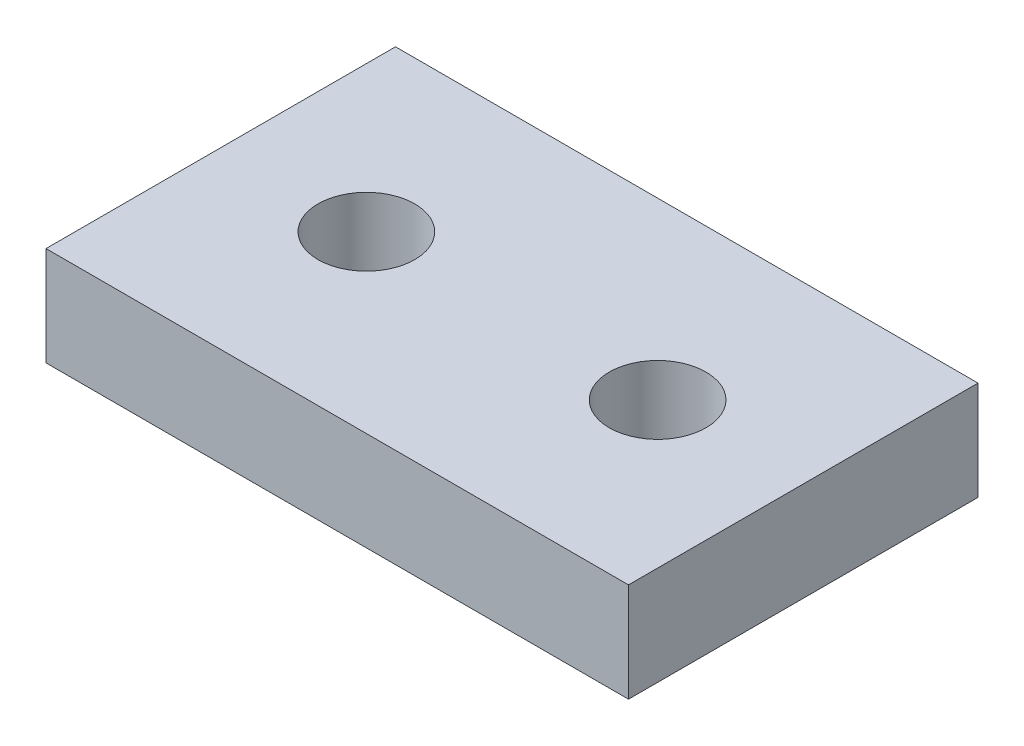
ISO-10303-21;
HEADER;
FILE_DESCRIPTION(('STEP AP214'),'2;1');
FILE_NAME('part.step','',(''),(''),'','','');
FILE_SCHEMA(('AUTOMOTIVE_DESIGN { 1 0 10303 214 1 1 1 1 }'));
ENDSEC;
DATA;
#1=APPLICATION_CONTEXT('core data for automotive mechanical design processes');
#2=APPLICATION_PROTOCOL_DEFINITION('international standard','automotive_design',2000,#1);
#3=PRODUCT_CONTEXT('',#1,'mechanical');
#4=PRODUCT('Part','Part','',(#3));
#5=PRODUCT_RELATED_PRODUCT_CATEGORY('part','',(#4));
#6=PRODUCT_DEFINITION_FORMATION('','',#4);
#7=PRODUCT_DEFINITION_CONTEXT('part definition',#1,'design');
#8=PRODUCT_DEFINITION('design','',#6,#7);
#9=PRODUCT_DEFINITION_SHAPE('','',#8);
#10=(LENGTH_UNIT() NAMED_UNIT(*) SI_UNIT(.MILLI.,.METRE.));
#11=(NAMED_UNIT(*) PLANE_ANGLE_UNIT() SI_UNIT($,.RADIAN.));
#12=(NAMED_UNIT(*) SI_UNIT($,.STERADIAN.) SOLID_ANGLE_UNIT());
#13=UNCERTAINTY_MEASURE_WITH_UNIT(LENGTH_MEASURE(1.E-05),#10,'distance_accuracy_value','');
#14=(GEOMETRIC_REPRESENTATION_CONTEXT(3) GLOBAL_UNCERTAINTY_ASSIGNED_CONTEXT((#13)) GLOBAL_UNIT_ASSIGNED_CONTEXT((#10,
#11,#12)) REPRESENTATION_CONTEXT('',''));
#15=CARTESIAN_POINT('',(0.,0.,0.));
#16=DIRECTION('',(0.,0.,1.));
#17=DIRECTION('',(1.,0.,0.));
#18=AXIS2_PLACEMENT_3D('',#15,#16,#17);
#19=CARTESIAN_POINT('',(-25.,8.5,15.));
#20=DIRECTION('',(0.,0.,-1.));
#21=DIRECTION('',(0.,-1.,0.));
#22=AXIS2_PLACEMENT_3D('',#19,#20,#21);
#23=PLANE('',#22);
#24=DIRECTION('',(1.,0.,0.));
#25=VECTOR('',#24,1.);
#26=CARTESIAN_POINT('',(-25.,0.,15.));
#27=LINE('',#26,#25);
#28=CARTESIAN_POINT('',(-25.,0.,15.));
#29=VERTEX_POINT('',#28);
#30=CARTESIAN_POINT('',(25.,0.,15.));
#31=VERTEX_POINT('',#30);
#32=EDGE_CURVE('E127',#29,#31,#27,.T.);
#33=ORIENTED_EDGE('',*,*,#32,.T.);
#34=DIRECTION('',(0.,-1.,0.));
#35=VECTOR('',#34,1.);
#36=CARTESIAN_POINT('',(25.,8.5,15.));
#37=LINE('',#36,#35);
#38=CARTESIAN_POINT('',(25.,8.5,15.));
#39=VERTEX_POINT('',#38);
#40=EDGE_CURVE('E64',#39,#31,#37,.T.);
#41=ORIENTED_EDGE('',*,*,#40,.F.);
#42=DIRECTION('',(1.,0.,0.));
#43=VECTOR('',#42,1.);
#44=CARTESIAN_POINT('',(-25.,8.5,15.));
#45=LINE('',#44,#43);
#46=CARTESIAN_POINT('',(-25.,8.5,15.));
#47=VERTEX_POINT('',#46);
#48=EDGE_CURVE('E101',#47,#39,#45,.T.);
#49=ORIENTED_EDGE('',*,*,#48,.F.);
#50=DIRECTION('',(0.,-1.,0.));
#51=VECTOR('',#50,1.);
#52=CARTESIAN_POINT('',(-25.,8.5,15.));
#53=LINE('',#52,#51);
#54=EDGE_CURVE('E11',#47,#29,#53,.T.);
#55=ORIENTED_EDGE('',*,*,#54,.T.);
#56=EDGE_LOOP('',(#33,#41,#49,#55));
#57=FACE_BOUND('',#56,.T.);
#58=ADVANCED_FACE('F17',(#57),#23,.F.);
#59=CARTESIAN_POINT('',(-25.,8.5,15.));
#60=DIRECTION('',(1.,0.,0.));
#61=DIRECTION('',(0.,1.,0.));
#62=AXIS2_PLACEMENT_3D('',#59,#60,#61);
#63=PLANE('',#62);
#64=DIRECTION('',(0.,0.,1.));
#65=VECTOR('',#64,1.);
#66=CARTESIAN_POINT('',(-25.,0.,15.));
#67=LINE('',#66,#65);
#68=CARTESIAN_POINT('',(-25.,0.,-15.));
#69=VERTEX_POINT('',#68);
#70=EDGE_CURVE('E128',#69,#29,#67,.T.);
#71=ORIENTED_EDGE('',*,*,#70,.T.);
#72=ORIENTED_EDGE('',*,*,#54,.F.);
#73=DIRECTION('',(0.,0.,1.));
#74=VECTOR('',#73,1.);
#75=CARTESIAN_POINT('',(-25.,8.5,15.));
#76=LINE('',#75,#74);
#77=CARTESIAN_POINT('',(-25.,8.5,-15.));
#78=VERTEX_POINT('',#77);
#79=EDGE_CURVE('E98',#78,#47,#76,.T.);
#80=ORIENTED_EDGE('',*,*,#79,.F.);
#81=DIRECTION('',(0.,-1.,0.));
#82=VECTOR('',#81,1.);
#83=CARTESIAN_POINT('',(-25.,8.5,-15.));
#84=LINE('',#83,#82);
#85=EDGE_CURVE('E20',#78,#69,#84,.T.);
#86=ORIENTED_EDGE('',*,*,#85,.T.);
#87=EDGE_LOOP('',(#71,#72,#80,#86));
#88=FACE_BOUND('',#87,.T.);
#89=ADVANCED_FACE('F138',(#88),#63,.F.);
#90=CARTESIAN_POINT('',(-25.,8.5,-15.));
#91=DIRECTION('',(0.,0.,1.));
#92=DIRECTION('',(1.,0.,0.));
#93=AXIS2_PLACEMENT_3D('',#90,#91,#92);
#94=PLANE('',#93);
#95=DIRECTION('',(-1.,0.,0.));
#96=VECTOR('',#95,1.);
#97=CARTESIAN_POINT('',(-25.,0.,-15.));
#98=LINE('',#97,#96);
#99=CARTESIAN_POINT('',(25.,0.,-15.));
#100=VERTEX_POINT('',#99);
#101=EDGE_CURVE('E91',#100,#69,#98,.T.);
#102=ORIENTED_EDGE('',*,*,#101,.T.);
#103=ORIENTED_EDGE('',*,*,#85,.F.);
#104=DIRECTION('',(-1.,0.,0.));
#105=VECTOR('',#104,1.);
#106=CARTESIAN_POINT('',(-25.,8.5,-15.));
#107=LINE('',#106,#105);
#108=CARTESIAN_POINT('',(25.,8.5,-15.));
#109=VERTEX_POINT('',#108);
#110=EDGE_CURVE('E93',#109,#78,#107,.T.);
#111=ORIENTED_EDGE('',*,*,#110,.F.);
#112=DIRECTION('',(0.,-1.,0.));
#113=VECTOR('',#112,1.);
#114=CARTESIAN_POINT('',(25.,8.5,-15.));
#115=LINE('',#114,#113);
#116=EDGE_CURVE('E81',#109,#100,#115,.T.);
#117=ORIENTED_EDGE('',*,*,#116,.T.);
#118=EDGE_LOOP('',(#102,#103,#111,#117));
#119=FACE_BOUND('',#118,.T.);
#120=ADVANCED_FACE('F94',(#119),#94,.F.);
#121=CARTESIAN_POINT('',(25.,8.5,15.));
#122=DIRECTION('',(-1.,0.,0.));
#123=DIRECTION('',(0.,0.,1.));
#124=AXIS2_PLACEMENT_3D('',#121,#122,#123);
#125=PLANE('',#124);
#126=DIRECTION('',(0.,0.,-1.));
#127=VECTOR('',#126,1.);
#128=CARTESIAN_POINT('',(25.,0.,15.));
#129=LINE('',#128,#127);
#130=EDGE_CURVE('E87',#31,#100,#129,.T.);
#131=ORIENTED_EDGE('',*,*,#130,.T.);
#132=ORIENTED_EDGE('',*,*,#116,.F.);
#133=DIRECTION('',(0.,0.,-1.));
#134=VECTOR('',#133,1.);
#135=CARTESIAN_POINT('',(25.,8.5,15.));
#136=LINE('',#135,#134);
#137=EDGE_CURVE('E85',#39,#109,#136,.T.);
#138=ORIENTED_EDGE('',*,*,#137,.F.);
#139=ORIENTED_EDGE('',*,*,#40,.T.);
#140=EDGE_LOOP('',(#131,#132,#138,#139));
#141=FACE_BOUND('',#140,.T.);
#142=ADVANCED_FACE('F83',(#141),#125,.F.);
#143=CARTESIAN_POINT('',(0.,0.,0.));
#144=DIRECTION('',(0.,-1.,0.));
#145=DIRECTION('',(0.,0.,-1.));
#146=AXIS2_PLACEMENT_3D('',#143,#144,#145);
#147=PLANE('',#146);
#148=CARTESIAN_POINT('',(12.5,0.,0.));
#149=DIRECTION('',(0.,1.,0.));
#150=DIRECTION('',(0.,0.,1.));
#151=AXIS2_PLACEMENT_3D('',#148,#149,#150);
#152=CIRCLE('',#151,4.15);
#153=CARTESIAN_POINT('',(12.5,0.,4.15));
#154=VERTEX_POINT('',#153);
#155=EDGE_CURVE('E116',#154,#154,#152,.T.);
#156=ORIENTED_EDGE('',*,*,#155,.T.);
#157=EDGE_LOOP('',(#156));
#158=FACE_BOUND('',#157,.T.);
#159=CARTESIAN_POINT('',(-12.5,0.,0.));
#160=DIRECTION('',(0.,1.,0.));
#161=DIRECTION('',(0.,0.,1.));
#162=AXIS2_PLACEMENT_3D('',#159,#160,#161);
#163=CIRCLE('',#162,4.15);
#164=CARTESIAN_POINT('',(-12.5,0.,4.15));
#165=VERTEX_POINT('',#164);
#166=EDGE_CURVE('E103',#165,#165,#163,.T.);
#167=ORIENTED_EDGE('',*,*,#166,.T.);
#168=EDGE_LOOP('',(#167));
#169=FACE_BOUND('',#168,.T.);
#170=ORIENTED_EDGE('',*,*,#130,.F.);
#171=ORIENTED_EDGE('',*,*,#32,.F.);
#172=ORIENTED_EDGE('',*,*,#70,.F.);
#173=ORIENTED_EDGE('',*,*,#101,.F.);
#174=EDGE_LOOP('',(#170,#171,#172,#173));
#175=FACE_BOUND('',#174,.T.);
#176=ADVANCED_FACE('F137',(#158,#169,#175),#147,.T.);
#177=CARTESIAN_POINT('',(0.,8.5,0.));
#178=DIRECTION('',(0.,-1.,0.));
#179=DIRECTION('',(0.,0.,-1.));
#180=AXIS2_PLACEMENT_3D('',#177,#178,#179);
#181=PLANE('',#180);
#182=CARTESIAN_POINT('',(12.5,8.5,0.));
#183=DIRECTION('',(0.,1.,0.));
#184=DIRECTION('',(0.,0.,1.));
#185=AXIS2_PLACEMENT_3D('',#182,#183,#184);
#186=CIRCLE('',#185,4.15);
#187=CARTESIAN_POINT('',(12.5,8.5,4.15));
#188=VERTEX_POINT('',#187);
#189=EDGE_CURVE('E119',#188,#188,#186,.T.);
#190=ORIENTED_EDGE('',*,*,#189,.F.);
#191=EDGE_LOOP('',(#190));
#192=FACE_BOUND('',#191,.T.);
#193=CARTESIAN_POINT('',(-12.5,8.5,0.));
#194=DIRECTION('',(0.,1.,0.));
#195=DIRECTION('',(0.,0.,1.));
#196=AXIS2_PLACEMENT_3D('',#193,#194,#195);
#197=CIRCLE('',#196,4.15);
#198=CARTESIAN_POINT('',(-12.5,8.5,4.15));
#199=VERTEX_POINT('',#198);
#200=EDGE_CURVE('E111',#199,#199,#197,.T.);
#201=ORIENTED_EDGE('',*,*,#200,.F.);
#202=EDGE_LOOP('',(#201));
#203=FACE_BOUND('',#202,.T.);
#204=ORIENTED_EDGE('',*,*,#137,.T.);
#205=ORIENTED_EDGE('',*,*,#110,.T.);
#206=ORIENTED_EDGE('',*,*,#79,.T.);
#207=ORIENTED_EDGE('',*,*,#48,.T.);
#208=EDGE_LOOP('',(#204,#205,#206,#207));
#209=FACE_BOUND('',#208,.T.);
#210=ADVANCED_FACE('F100',(#192,#203,#209),#181,.F.);
#211=CARTESIAN_POINT('',(-12.5,8.5,0.));
#212=DIRECTION('',(0.,-1.,0.));
#213=DIRECTION('',(0.,0.,-1.));
#214=AXIS2_PLACEMENT_3D('',#211,#212,#213);
#215=CYLINDRICAL_SURFACE('',#214,4.15);
#216=ORIENTED_EDGE('',*,*,#166,.F.);
#217=EDGE_LOOP('',(#216));
#218=FACE_BOUND('',#217,.T.);
#219=ORIENTED_EDGE('',*,*,#200,.T.);
#220=EDGE_LOOP('',(#219));
#221=FACE_BOUND('',#220,.T.);
#222=ADVANCED_FACE('F148',(#218,#221),#215,.F.);
#223=CARTESIAN_POINT('',(12.5,8.5,0.));
#224=DIRECTION('',(0.,-1.,0.));
#225=DIRECTION('',(0.,0.,-1.));
#226=AXIS2_PLACEMENT_3D('',#223,#224,#225);
#227=CYLINDRICAL_SURFACE('',#226,4.15);
#228=ORIENTED_EDGE('',*,*,#155,.F.);
#229=EDGE_LOOP('',(#228));
#230=FACE_BOUND('',#229,.T.);
#231=ORIENTED_EDGE('',*,*,#189,.T.);
#232=EDGE_LOOP('',(#231));
#233=FACE_BOUND('',#232,.T.);
#234=ADVANCED_FACE('F165',(#230,#233),#227,.F.);
#235=CLOSED_SHELL('',(#58,#89,#120,#142,#176,#210,#222,#234));
#236=MANIFOLD_SOLID_BREP('B1',#235);
#237=ADVANCED_BREP_SHAPE_REPRESENTATION('',(#18,#236),#14);
#238=SHAPE_DEFINITION_REPRESENTATION(#9,#237);
ENDSEC;
END-ISO-10303-21;
